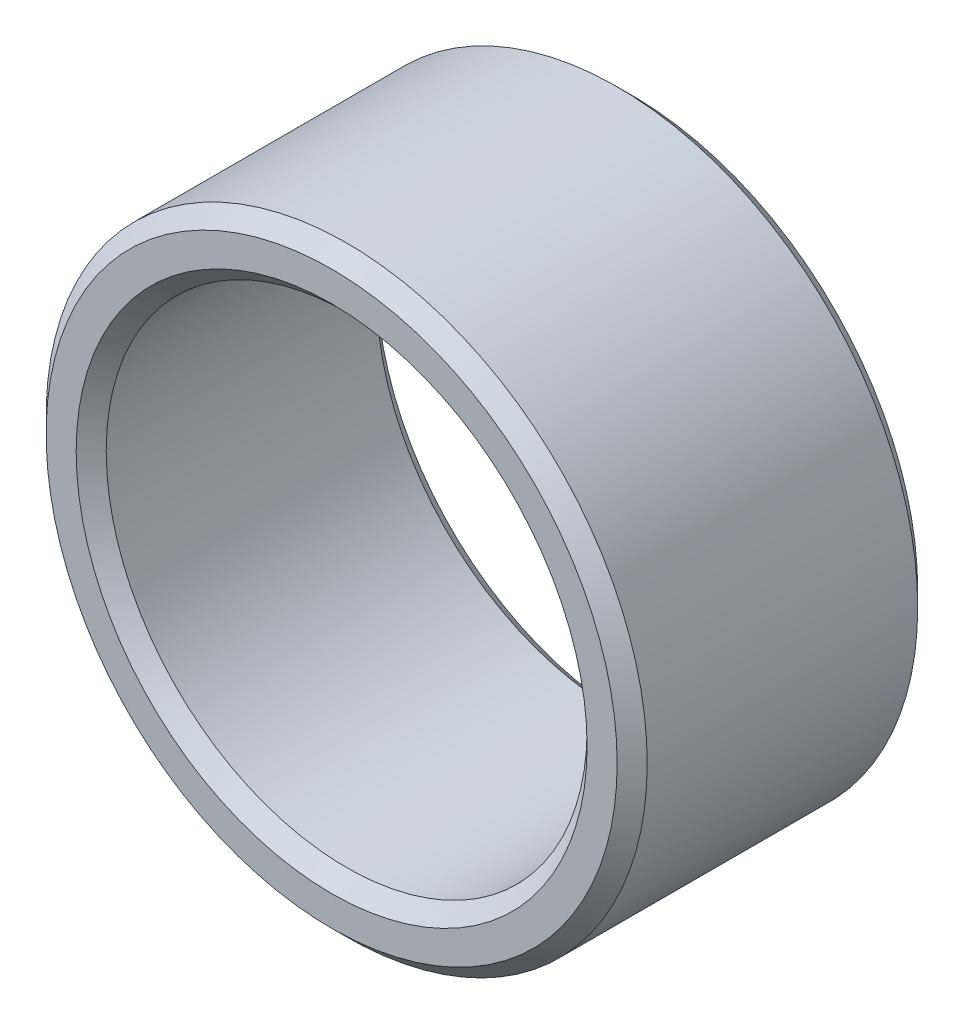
ISO-10303-21;
HEADER;
FILE_DESCRIPTION(('STEP AP214'),'2;1');
FILE_NAME('part.step','',(''),(''),'','','');
FILE_SCHEMA(('AUTOMOTIVE_DESIGN { 1 0 10303 214 1 1 1 1 }'));
ENDSEC;
DATA;
#1=APPLICATION_CONTEXT('core data for automotive mechanical design processes');
#2=APPLICATION_PROTOCOL_DEFINITION('international standard','automotive_design',2000,#1);
#3=PRODUCT_CONTEXT('',#1,'mechanical');
#4=PRODUCT('Part','Part','',(#3));
#5=PRODUCT_RELATED_PRODUCT_CATEGORY('part','',(#4));
#6=PRODUCT_DEFINITION_FORMATION('','',#4);
#7=PRODUCT_DEFINITION_CONTEXT('part definition',#1,'design');
#8=PRODUCT_DEFINITION('design','',#6,#7);
#9=PRODUCT_DEFINITION_SHAPE('','',#8);
#10=(LENGTH_UNIT() NAMED_UNIT(*) SI_UNIT(.MILLI.,.METRE.));
#11=(NAMED_UNIT(*) PLANE_ANGLE_UNIT() SI_UNIT($,.RADIAN.));
#12=(NAMED_UNIT(*) SI_UNIT($,.STERADIAN.) SOLID_ANGLE_UNIT());
#13=UNCERTAINTY_MEASURE_WITH_UNIT(LENGTH_MEASURE(1.E-05),#10,'distance_accuracy_value','');
#14=(GEOMETRIC_REPRESENTATION_CONTEXT(3) GLOBAL_UNCERTAINTY_ASSIGNED_CONTEXT((#13)) GLOBAL_UNIT_ASSIGNED_CONTEXT((#10,
#11,#12)) REPRESENTATION_CONTEXT('',''));
#15=CARTESIAN_POINT('',(0.,0.,0.));
#16=DIRECTION('',(0.,0.,1.));
#17=DIRECTION('',(1.,0.,0.));
#18=AXIS2_PLACEMENT_3D('',#15,#16,#17);
#19=CARTESIAN_POINT('',(0.,0.,20.));
#20=DIRECTION('',(0.,0.,1.));
#21=DIRECTION('',(1.,0.,0.));
#22=AXIS2_PLACEMENT_3D('',#19,#20,#21);
#23=PLANE('',#22);
#24=CARTESIAN_POINT('',(0.,0.,20.));
#25=DIRECTION('',(0.,0.,1.));
#26=DIRECTION('',(1.,0.,0.));
#27=AXIS2_PLACEMENT_3D('',#24,#25,#26);
#28=CIRCLE('',#27,17.);
#29=CARTESIAN_POINT('',(17.,0.,20.));
#30=VERTEX_POINT('',#29);
#31=EDGE_CURVE('E10',#30,#30,#28,.F.);
#32=ORIENTED_EDGE('',*,*,#31,.T.);
#33=EDGE_LOOP('',(#32));
#34=FACE_BOUND('',#33,.T.);
#35=CARTESIAN_POINT('',(0.,0.,20.));
#36=DIRECTION('',(0.,0.,1.));
#37=DIRECTION('',(1.,0.,0.));
#38=AXIS2_PLACEMENT_3D('',#35,#36,#37);
#39=CIRCLE('',#38,19.);
#40=CARTESIAN_POINT('',(19.,0.,20.));
#41=VERTEX_POINT('',#40);
#42=EDGE_CURVE('E37',#41,#41,#39,.T.);
#43=ORIENTED_EDGE('',*,*,#42,.T.);
#44=EDGE_LOOP('',(#43));
#45=FACE_BOUND('',#44,.T.);
#46=ADVANCED_FACE('F30',(#34,#45),#23,.T.);
#47=CARTESIAN_POINT('',(0.,0.,0.));
#48=DIRECTION('',(0.,0.,1.));
#49=DIRECTION('',(1.,0.,0.));
#50=AXIS2_PLACEMENT_3D('',#47,#48,#49);
#51=PLANE('',#50);
#52=CARTESIAN_POINT('',(0.,0.,0.));
#53=DIRECTION('',(0.,0.,1.));
#54=DIRECTION('',(1.,0.,0.));
#55=AXIS2_PLACEMENT_3D('',#52,#53,#54);
#56=CIRCLE('',#55,17.);
#57=CARTESIAN_POINT('',(17.,0.,0.));
#58=VERTEX_POINT('',#57);
#59=EDGE_CURVE('E56',#58,#58,#56,.T.);
#60=ORIENTED_EDGE('',*,*,#59,.T.);
#61=EDGE_LOOP('',(#60));
#62=FACE_BOUND('',#61,.T.);
#63=CARTESIAN_POINT('',(0.,0.,0.));
#64=DIRECTION('',(0.,0.,1.));
#65=DIRECTION('',(1.,0.,0.));
#66=AXIS2_PLACEMENT_3D('',#63,#64,#65);
#67=CIRCLE('',#66,19.);
#68=CARTESIAN_POINT('',(19.,0.,0.));
#69=VERTEX_POINT('',#68);
#70=EDGE_CURVE('E59',#69,#69,#67,.F.);
#71=ORIENTED_EDGE('',*,*,#70,.T.);
#72=EDGE_LOOP('',(#71));
#73=FACE_BOUND('',#72,.T.);
#74=ADVANCED_FACE('F63',(#62,#73),#51,.F.);
#75=CARTESIAN_POINT('',(0.,0.,20.));
#76=DIRECTION('',(0.,0.,-1.));
#77=DIRECTION('',(-1.,0.,0.));
#78=AXIS2_PLACEMENT_3D('',#75,#76,#77);
#79=CYLINDRICAL_SURFACE('',#78,20.);
#80=CARTESIAN_POINT('',(0.,0.,1.));
#81=DIRECTION('',(0.,0.,1.));
#82=DIRECTION('',(1.,0.,0.));
#83=AXIS2_PLACEMENT_3D('',#80,#81,#82);
#84=CIRCLE('',#83,20.);
#85=CARTESIAN_POINT('',(20.,0.,1.));
#86=VERTEX_POINT('',#85);
#87=EDGE_CURVE('E41',#86,#86,#84,.T.);
#88=ORIENTED_EDGE('',*,*,#87,.T.);
#89=EDGE_LOOP('',(#88));
#90=FACE_BOUND('',#89,.T.);
#91=CARTESIAN_POINT('',(0.,0.,19.));
#92=DIRECTION('',(0.,0.,1.));
#93=DIRECTION('',(1.,0.,0.));
#94=AXIS2_PLACEMENT_3D('',#91,#92,#93);
#95=CIRCLE('',#94,20.);
#96=CARTESIAN_POINT('',(20.,0.,19.));
#97=VERTEX_POINT('',#96);
#98=EDGE_CURVE('E45',#97,#97,#95,.F.);
#99=ORIENTED_EDGE('',*,*,#98,.T.);
#100=EDGE_LOOP('',(#99));
#101=FACE_BOUND('',#100,.T.);
#102=ADVANCED_FACE('F73',(#90,#101),#79,.T.);
#103=CARTESIAN_POINT('',(0.,0.,20.));
#104=DIRECTION('',(0.,0.,-1.));
#105=DIRECTION('',(-1.,0.,0.));
#106=AXIS2_PLACEMENT_3D('',#103,#104,#105);
#107=CYLINDRICAL_SURFACE('',#106,16.);
#108=CARTESIAN_POINT('',(0.,0.,1.));
#109=DIRECTION('',(0.,0.,1.));
#110=DIRECTION('',(1.,0.,0.));
#111=AXIS2_PLACEMENT_3D('',#108,#109,#110);
#112=CIRCLE('',#111,16.);
#113=CARTESIAN_POINT('',(16.,0.,1.));
#114=VERTEX_POINT('',#113);
#115=EDGE_CURVE('E50',#114,#114,#112,.F.);
#116=ORIENTED_EDGE('',*,*,#115,.T.);
#117=EDGE_LOOP('',(#116));
#118=FACE_BOUND('',#117,.T.);
#119=CARTESIAN_POINT('',(0.,0.,19.));
#120=DIRECTION('',(0.,0.,1.));
#121=DIRECTION('',(1.,0.,0.));
#122=AXIS2_PLACEMENT_3D('',#119,#120,#121);
#123=CIRCLE('',#122,16.);
#124=CARTESIAN_POINT('',(16.,0.,19.));
#125=VERTEX_POINT('',#124);
#126=EDGE_CURVE('E53',#125,#125,#123,.T.);
#127=ORIENTED_EDGE('',*,*,#126,.T.);
#128=EDGE_LOOP('',(#127));
#129=FACE_BOUND('',#128,.T.);
#130=ADVANCED_FACE('F76',(#118,#129),#107,.F.);
#131=CARTESIAN_POINT('',(0.,0.,0.));
#132=DIRECTION('',(0.,0.,-1.));
#133=DIRECTION('',(-1.,0.,0.));
#134=AXIS2_PLACEMENT_3D('',#131,#132,#133);
#135=CONICAL_SURFACE('',#134,17.,0.785398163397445);
#136=ORIENTED_EDGE('',*,*,#115,.F.);
#137=EDGE_LOOP('',(#136));
#138=FACE_BOUND('',#137,.T.);
#139=ORIENTED_EDGE('',*,*,#59,.F.);
#140=EDGE_LOOP('',(#139));
#141=FACE_BOUND('',#140,.T.);
#142=ADVANCED_FACE('F69',(#138,#141),#135,.F.);
#143=CARTESIAN_POINT('',(0.,0.,1.));
#144=DIRECTION('',(0.,0.,1.));
#145=DIRECTION('',(1.,0.,0.));
#146=AXIS2_PLACEMENT_3D('',#143,#144,#145);
#147=CONICAL_SURFACE('',#146,20.,0.785398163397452);
#148=ORIENTED_EDGE('',*,*,#70,.F.);
#149=EDGE_LOOP('',(#148));
#150=FACE_BOUND('',#149,.T.);
#151=ORIENTED_EDGE('',*,*,#87,.F.);
#152=EDGE_LOOP('',(#151));
#153=FACE_BOUND('',#152,.T.);
#154=ADVANCED_FACE('F65',(#150,#153),#147,.T.);
#155=CARTESIAN_POINT('',(0.,0.,19.));
#156=DIRECTION('',(0.,0.,1.));
#157=DIRECTION('',(1.,0.,0.));
#158=AXIS2_PLACEMENT_3D('',#155,#156,#157);
#159=CONICAL_SURFACE('',#158,16.,0.78539816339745);
#160=ORIENTED_EDGE('',*,*,#31,.F.);
#161=EDGE_LOOP('',(#160));
#162=FACE_BOUND('',#161,.T.);
#163=ORIENTED_EDGE('',*,*,#126,.F.);
#164=EDGE_LOOP('',(#163));
#165=FACE_BOUND('',#164,.T.);
#166=ADVANCED_FACE('F68',(#162,#165),#159,.F.);
#167=CARTESIAN_POINT('',(0.,0.,20.));
#168=DIRECTION('',(0.,0.,-1.));
#169=DIRECTION('',(-1.,0.,0.));
#170=AXIS2_PLACEMENT_3D('',#167,#168,#169);
#171=CONICAL_SURFACE('',#170,19.,0.785398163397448);
#172=ORIENTED_EDGE('',*,*,#98,.F.);
#173=EDGE_LOOP('',(#172));
#174=FACE_BOUND('',#173,.T.);
#175=ORIENTED_EDGE('',*,*,#42,.F.);
#176=EDGE_LOOP('',(#175));
#177=FACE_BOUND('',#176,.T.);
#178=ADVANCED_FACE('F32',(#174,#177),#171,.T.);
#179=CLOSED_SHELL('',(#46,#74,#102,#130,#142,#154,#166,#178));
#180=MANIFOLD_SOLID_BREP('B2',#179);
#181=ADVANCED_BREP_SHAPE_REPRESENTATION('',(#18,#180),#14);
#182=SHAPE_DEFINITION_REPRESENTATION(#9,#181);
ENDSEC;
END-ISO-10303-21;
